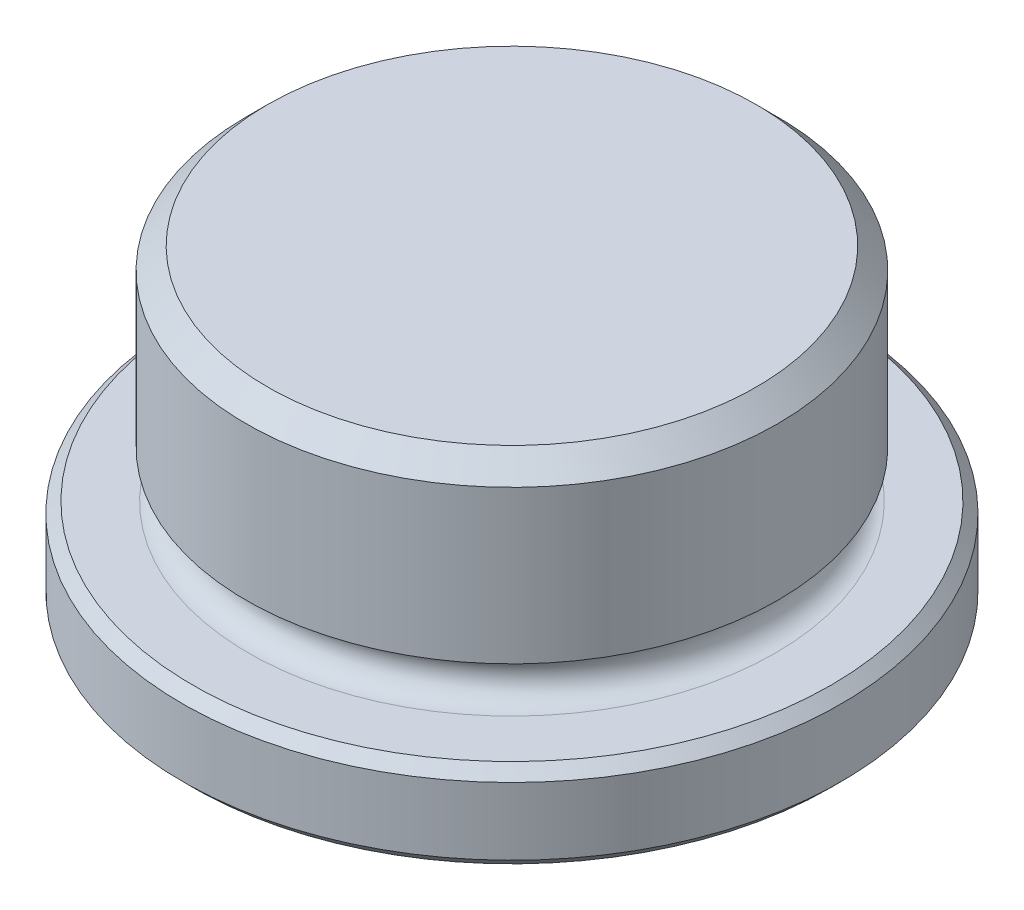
ISO-10303-21;
HEADER;
FILE_DESCRIPTION(('STEP AP214'),'2;1');
FILE_NAME('part.step','',(''),(''),'','','');
FILE_SCHEMA(('AUTOMOTIVE_DESIGN { 1 0 10303 214 1 1 1 1 }'));
ENDSEC;
DATA;
#1=APPLICATION_CONTEXT('core data for automotive mechanical design processes');
#2=APPLICATION_PROTOCOL_DEFINITION('international standard','automotive_design',2000,#1);
#3=PRODUCT_CONTEXT('',#1,'mechanical');
#4=PRODUCT('Part','Part','',(#3));
#5=PRODUCT_RELATED_PRODUCT_CATEGORY('part','',(#4));
#6=PRODUCT_DEFINITION_FORMATION('','',#4);
#7=PRODUCT_DEFINITION_CONTEXT('part definition',#1,'design');
#8=PRODUCT_DEFINITION('design','',#6,#7);
#9=PRODUCT_DEFINITION_SHAPE('','',#8);
#10=(LENGTH_UNIT() NAMED_UNIT(*) SI_UNIT(.MILLI.,.METRE.));
#11=(NAMED_UNIT(*) PLANE_ANGLE_UNIT() SI_UNIT($,.RADIAN.));
#12=(NAMED_UNIT(*) SI_UNIT($,.STERADIAN.) SOLID_ANGLE_UNIT());
#13=UNCERTAINTY_MEASURE_WITH_UNIT(LENGTH_MEASURE(1.E-05),#10,'distance_accuracy_value','');
#14=(GEOMETRIC_REPRESENTATION_CONTEXT(3) GLOBAL_UNCERTAINTY_ASSIGNED_CONTEXT((#13)) GLOBAL_UNIT_ASSIGNED_CONTEXT((#10,
#11,#12)) REPRESENTATION_CONTEXT('',''));
#15=CARTESIAN_POINT('',(0.,0.,0.));
#16=DIRECTION('',(0.,0.,1.));
#17=DIRECTION('',(1.,0.,0.));
#18=AXIS2_PLACEMENT_3D('',#15,#16,#17);
#19=CARTESIAN_POINT('',(8.763,11.0998,0.));
#20=DIRECTION('',(0.,-1.,0.));
#21=DIRECTION('',(1.,0.,0.));
#22=AXIS2_PLACEMENT_3D('',#19,#20,#21);
#23=PLANE('',#22);
#24=CARTESIAN_POINT('',(0.,11.0998,0.));
#25=DIRECTION('',(0.,1.,0.));
#26=DIRECTION('',(-1.,0.,0.));
#27=AXIS2_PLACEMENT_3D('',#24,#25,#26);
#28=CIRCLE('',#27,8.763);
#29=CARTESIAN_POINT('',(-8.763,11.0998,0.));
#30=VERTEX_POINT('',#29);
#31=EDGE_CURVE('E52',#30,#30,#28,.T.);
#32=ORIENTED_EDGE('',*,*,#31,.T.);
#33=EDGE_LOOP('',(#32));
#34=FACE_BOUND('',#33,.T.);
#35=ADVANCED_FACE('F39',(#34),#23,.F.);
#36=CARTESIAN_POINT('',(0.,10.3378,0.));
#37=DIRECTION('',(0.,-1.,0.));
#38=DIRECTION('',(1.,0.,0.));
#39=AXIS2_PLACEMENT_3D('',#36,#37,#38);
#40=CONICAL_SURFACE('',#39,9.525,0.785398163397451);
#41=ORIENTED_EDGE('',*,*,#31,.F.);
#42=EDGE_LOOP('',(#41));
#43=FACE_BOUND('',#42,.T.);
#44=CARTESIAN_POINT('',(0.,10.3378,0.));
#45=DIRECTION('',(0.,1.,0.));
#46=DIRECTION('',(-1.,0.,0.));
#47=AXIS2_PLACEMENT_3D('',#44,#45,#46);
#48=CIRCLE('',#47,9.525);
#49=CARTESIAN_POINT('',(-9.525,10.3378,0.));
#50=VERTEX_POINT('',#49);
#51=EDGE_CURVE('E143',#50,#50,#48,.T.);
#52=ORIENTED_EDGE('',*,*,#51,.T.);
#53=EDGE_LOOP('',(#52));
#54=FACE_BOUND('',#53,.T.);
#55=ADVANCED_FACE('F149',(#43,#54),#40,.T.);
#56=CARTESIAN_POINT('',(0.,11.0998,0.));
#57=DIRECTION('',(0.,1.,0.));
#58=DIRECTION('',(-1.,0.,0.));
#59=AXIS2_PLACEMENT_3D('',#56,#57,#58);
#60=CYLINDRICAL_SURFACE('',#59,9.525);
#61=ORIENTED_EDGE('',*,*,#51,.F.);
#62=EDGE_LOOP('',(#61));
#63=FACE_BOUND('',#62,.T.);
#64=CARTESIAN_POINT('',(0.,4.85873556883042,0.));
#65=DIRECTION('',(0.,1.,0.));
#66=DIRECTION('',(-1.,0.,0.));
#67=AXIS2_PLACEMENT_3D('',#64,#65,#66);
#68=CIRCLE('',#67,9.525);
#69=CARTESIAN_POINT('',(-9.525,4.85873556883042,0.));
#70=VERTEX_POINT('',#69);
#71=EDGE_CURVE('E140',#70,#70,#68,.T.);
#72=ORIENTED_EDGE('',*,*,#71,.T.);
#73=EDGE_LOOP('',(#72));
#74=FACE_BOUND('',#73,.T.);
#75=ADVANCED_FACE('F152',(#63,#74),#60,.T.);
#76=CARTESIAN_POINT('',(0.,4.72675409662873,0.));
#77=DIRECTION('',(0.,1.,0.));
#78=DIRECTION('',(-1.,0.,0.));
#79=AXIS2_PLACEMENT_3D('',#76,#77,#78);
#80=CONICAL_SURFACE('',#79,9.16238388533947,1.22173047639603);
#81=ORIENTED_EDGE('',*,*,#71,.F.);
#82=EDGE_LOOP('',(#81));
#83=FACE_BOUND('',#82,.T.);
#84=CARTESIAN_POINT('',(0.,4.72675409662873,0.));
#85=DIRECTION('',(0.,1.,0.));
#86=DIRECTION('',(-1.,0.,0.));
#87=AXIS2_PLACEMENT_3D('',#84,#85,#86);
#88=CIRCLE('',#87,9.16238388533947);
#89=CARTESIAN_POINT('',(-9.16238388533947,4.72675409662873,0.));
#90=VERTEX_POINT('',#89);
#91=EDGE_CURVE('E137',#90,#90,#88,.T.);
#92=ORIENTED_EDGE('',*,*,#91,.T.);
#93=EDGE_LOOP('',(#92));
#94=FACE_BOUND('',#93,.T.);
#95=ADVANCED_FACE('F157',(#83,#94),#80,.T.);
#96=CARTESIAN_POINT('',(0.,3.975,0.));
#97=DIRECTION('',(0.,1.,0.));
#98=DIRECTION('',(-1.,0.,0.));
#99=AXIS2_PLACEMENT_3D('',#96,#97,#98);
#100=TOROIDAL_SURFACE('',#99,9.436,0.799999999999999);
#101=ORIENTED_EDGE('',*,*,#91,.F.);
#102=EDGE_LOOP('',(#101));
#103=FACE_BOUND('',#102,.T.);
#104=CARTESIAN_POINT('',(0.,3.175,0.));
#105=DIRECTION('',(0.,1.,0.));
#106=DIRECTION('',(-1.,0.,0.));
#107=AXIS2_PLACEMENT_3D('',#104,#105,#106);
#108=CIRCLE('',#107,9.436);
#109=CARTESIAN_POINT('',(-9.436,3.175,0.));
#110=VERTEX_POINT('',#109);
#111=EDGE_CURVE('E134',#110,#110,#108,.T.);
#112=ORIENTED_EDGE('',*,*,#111,.T.);
#113=EDGE_LOOP('',(#112));
#114=FACE_BOUND('',#113,.T.);
#115=ADVANCED_FACE('F163',(#103,#114),#100,.F.);
#116=CARTESIAN_POINT('',(11.43,3.175,0.));
#117=DIRECTION('',(0.,-1.,0.));
#118=DIRECTION('',(1.,0.,0.));
#119=AXIS2_PLACEMENT_3D('',#116,#117,#118);
#120=PLANE('',#119);
#121=ORIENTED_EDGE('',*,*,#111,.F.);
#122=EDGE_LOOP('',(#121));
#123=FACE_BOUND('',#122,.T.);
#124=CARTESIAN_POINT('',(0.,3.175,0.));
#125=DIRECTION('',(0.,1.,0.));
#126=DIRECTION('',(-1.,0.,0.));
#127=AXIS2_PLACEMENT_3D('',#124,#125,#126);
#128=CIRCLE('',#127,11.43);
#129=CARTESIAN_POINT('',(-11.43,3.175,0.));
#130=VERTEX_POINT('',#129);
#131=EDGE_CURVE('E131',#130,#130,#128,.T.);
#132=ORIENTED_EDGE('',*,*,#131,.T.);
#133=EDGE_LOOP('',(#132));
#134=FACE_BOUND('',#133,.T.);
#135=ADVANCED_FACE('F169',(#123,#134),#120,.F.);
#136=CARTESIAN_POINT('',(0.,2.794,0.));
#137=DIRECTION('',(0.,-1.,0.));
#138=DIRECTION('',(1.,0.,0.));
#139=AXIS2_PLACEMENT_3D('',#136,#137,#138);
#140=CONICAL_SURFACE('',#139,11.811,0.785398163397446);
#141=ORIENTED_EDGE('',*,*,#131,.F.);
#142=EDGE_LOOP('',(#141));
#143=FACE_BOUND('',#142,.T.);
#144=CARTESIAN_POINT('',(0.,2.794,0.));
#145=DIRECTION('',(0.,1.,0.));
#146=DIRECTION('',(-1.,0.,0.));
#147=AXIS2_PLACEMENT_3D('',#144,#145,#146);
#148=CIRCLE('',#147,11.811);
#149=CARTESIAN_POINT('',(-11.811,2.794,0.));
#150=VERTEX_POINT('',#149);
#151=EDGE_CURVE('E128',#150,#150,#148,.T.);
#152=ORIENTED_EDGE('',*,*,#151,.T.);
#153=EDGE_LOOP('',(#152));
#154=FACE_BOUND('',#153,.T.);
#155=ADVANCED_FACE('F175',(#143,#154),#140,.T.);
#156=CARTESIAN_POINT('',(0.,11.0998,0.));
#157=DIRECTION('',(0.,1.,0.));
#158=DIRECTION('',(-1.,0.,0.));
#159=AXIS2_PLACEMENT_3D('',#156,#157,#158);
#160=CYLINDRICAL_SURFACE('',#159,11.811);
#161=ORIENTED_EDGE('',*,*,#151,.F.);
#162=EDGE_LOOP('',(#161));
#163=FACE_BOUND('',#162,.T.);
#164=CARTESIAN_POINT('',(0.,0.380999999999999,0.));
#165=DIRECTION('',(0.,1.,0.));
#166=DIRECTION('',(-1.,0.,0.));
#167=AXIS2_PLACEMENT_3D('',#164,#165,#166);
#168=CIRCLE('',#167,11.811);
#169=CARTESIAN_POINT('',(-11.811,0.381,0.));
#170=VERTEX_POINT('',#169);
#171=EDGE_CURVE('E125',#170,#170,#168,.T.);
#172=ORIENTED_EDGE('',*,*,#171,.T.);
#173=EDGE_LOOP('',(#172));
#174=FACE_BOUND('',#173,.T.);
#175=ADVANCED_FACE('F181',(#163,#174),#160,.T.);
#176=CARTESIAN_POINT('',(0.,0.,0.));
#177=DIRECTION('',(0.,1.,0.));
#178=DIRECTION('',(-1.,0.,0.));
#179=AXIS2_PLACEMENT_3D('',#176,#177,#178);
#180=CONICAL_SURFACE('',#179,11.43,0.785398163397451);
#181=ORIENTED_EDGE('',*,*,#171,.F.);
#182=EDGE_LOOP('',(#181));
#183=FACE_BOUND('',#182,.T.);
#184=CARTESIAN_POINT('',(0.,0.,0.));
#185=DIRECTION('',(0.,1.,0.));
#186=DIRECTION('',(-1.,0.,0.));
#187=AXIS2_PLACEMENT_3D('',#184,#185,#186);
#188=CIRCLE('',#187,11.43);
#189=CARTESIAN_POINT('',(-11.43,0.,0.));
#190=VERTEX_POINT('',#189);
#191=EDGE_CURVE('E122',#190,#190,#188,.T.);
#192=ORIENTED_EDGE('',*,*,#191,.T.);
#193=EDGE_LOOP('',(#192));
#194=FACE_BOUND('',#193,.T.);
#195=ADVANCED_FACE('F187',(#183,#194),#180,.T.);
#196=CARTESIAN_POINT('',(0.,0.,0.));
#197=DIRECTION('',(0.,1.,0.));
#198=DIRECTION('',(-1.,0.,0.));
#199=AXIS2_PLACEMENT_3D('',#196,#197,#198);
#200=PLANE('',#199);
#201=CARTESIAN_POINT('',(0.,0.,0.));
#202=DIRECTION('',(0.,1.,0.));
#203=DIRECTION('',(0.,0.,1.));
#204=AXIS2_PLACEMENT_3D('',#201,#202,#203);
#205=CIRCLE('',#204,5.75326131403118);
#206=CARTESIAN_POINT('',(0.,0.,5.75326131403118));
#207=VERTEX_POINT('',#206);
#208=EDGE_CURVE('E418',#207,#207,#205,.T.);
#209=ORIENTED_EDGE('',*,*,#208,.T.);
#210=EDGE_LOOP('',(#209));
#211=FACE_BOUND('',#210,.T.);
#212=ORIENTED_EDGE('',*,*,#191,.F.);
#213=EDGE_LOOP('',(#212));
#214=FACE_BOUND('',#213,.T.);
#215=ADVANCED_FACE('F193',(#211,#214),#200,.F.);
#216=CARTESIAN_POINT('',(0.,3.70346252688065,0.));
#217=DIRECTION('',(0.,-1.,0.));
#218=DIRECTION('',(0.,0.,-1.));
#219=AXIS2_PLACEMENT_3D('',#216,#217,#218);
#220=CONICAL_SURFACE('',#219,2.0497987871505,0.785398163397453);
#221=ORIENTED_EDGE('',*,*,#208,.F.);
#222=EDGE_LOOP('',(#221));
#223=FACE_BOUND('',#222,.T.);
#224=CARTESIAN_POINT('',(5.49937678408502,0.253884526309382,-0.000200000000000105));
#225=CARTESIAN_POINT('',(5.45209794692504,0.301159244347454,0.0816893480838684));
#226=CARTESIAN_POINT('',(5.40445569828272,0.346983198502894,0.164208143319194));
#227=CARTESIAN_POINT('',(5.30837307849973,0.435288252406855,0.330628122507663));
#228=CARTESIAN_POINT('',(5.25993228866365,0.477767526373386,0.414530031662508));
#229=CARTESIAN_POINT('',(5.11285510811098,0.599888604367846,0.669275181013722));
#230=CARTESIAN_POINT('',(5.01297361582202,0.673692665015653,0.842275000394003));
#231=CARTESIAN_POINT('',(4.81155458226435,0.800077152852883,1.19114300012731));
#232=CARTESIAN_POINT('',(4.71006852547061,0.852975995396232,1.36692200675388));
#233=CARTESIAN_POINT('',(4.55617092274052,0.914167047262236,1.63348047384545));
#234=CARTESIAN_POINT('',(4.5046451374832,0.931529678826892,1.72272575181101));
#235=CARTESIAN_POINT('',(4.40115727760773,0.959809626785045,1.90197198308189));
#236=CARTESIAN_POINT('',(4.34919526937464,0.970727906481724,1.99197282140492));
#237=CARTESIAN_POINT('',(4.22257233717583,0.98903382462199,2.2112901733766));
#238=CARTESIAN_POINT('',(4.14777498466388,0.992874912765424,2.34084298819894));
#239=CARTESIAN_POINT('',(3.99831507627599,0.986428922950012,2.59971514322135));
#240=CARTESIAN_POINT('',(3.92365257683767,0.976136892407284,2.72903438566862));
#241=CARTESIAN_POINT('',(3.77503146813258,0.942031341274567,2.98645369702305));
#242=CARTESIAN_POINT('',(3.7010737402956,0.91820269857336,3.11455223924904));
#243=CARTESIAN_POINT('',(3.554429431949,0.858319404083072,3.36854763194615));
#244=CARTESIAN_POINT('',(3.4817427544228,0.822265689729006,3.49444465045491));
#245=CARTESIAN_POINT('',(3.35270833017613,0.7480905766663,3.71793882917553));
#246=CARTESIAN_POINT('',(3.29607491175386,0.711919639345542,3.81603078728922));
#247=CARTESIAN_POINT('',(3.18382475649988,0.633748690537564,4.0104537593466));
#248=CARTESIAN_POINT('',(3.12820805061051,0.591748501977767,4.1067847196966));
#249=CARTESIAN_POINT('',(3.01816648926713,0.502860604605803,4.29738229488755));
#250=CARTESIAN_POINT('',(2.96373850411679,0.455988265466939,4.39165433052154));
#251=CARTESIAN_POINT('',(2.85589043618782,0.357971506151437,4.57845266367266));
#252=CARTESIAN_POINT('',(2.80246975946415,0.306829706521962,4.67097998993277));
#253=CARTESIAN_POINT('',(2.74951518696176,0.253884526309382,4.7627));
#254=B_SPLINE_CURVE_WITH_KNOTS('',3,(#224,#225,#226,#227,#228,#229,#230,#231,#232,#233,#234,
#235,#236,#237,#238,#239,#240,#241,#242,#243,#244,#245,#246,#247,#248,#249,#250,#251,#252,#253),
.UNSPECIFIED.,.F.,.F.,(4,2,2,2,2,2,2,2,2,2,2,2,2,2,4),(0.,0.317131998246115,0.634435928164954,
1.2724696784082,1.90037160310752,2.21370673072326,2.52699500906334,2.97522950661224,
3.42362111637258,3.87251462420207,4.32137371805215,4.67791268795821,5.03446249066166,
5.38991982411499,5.74516056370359),.UNSPECIFIED.);
#255=CARTESIAN_POINT('',(5.49926131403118,0.253999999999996,0.));
#256=VERTEX_POINT('',#255);
#257=CARTESIAN_POINT('',(2.74963065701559,0.253999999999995,4.7625));
#258=VERTEX_POINT('',#257);
#259=EDGE_CURVE('E106',#256,#258,#254,.T.);
#260=ORIENTED_EDGE('',*,*,#259,.F.);
#261=CARTESIAN_POINT('',(2.74951518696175,0.253884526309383,-4.7627));
#262=CARTESIAN_POINT('',(2.79679402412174,0.301159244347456,-4.68081065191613));
#263=CARTESIAN_POINT('',(2.84443627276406,0.346983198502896,-4.5982918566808));
#264=CARTESIAN_POINT('',(2.94051889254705,0.435288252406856,-4.43187187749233));
#265=CARTESIAN_POINT('',(2.98895968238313,0.477767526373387,-4.34796996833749));
#266=CARTESIAN_POINT('',(3.1360368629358,0.599888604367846,-4.09322481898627));
#267=CARTESIAN_POINT('',(3.23591835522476,0.673692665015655,-3.920224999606));
#268=CARTESIAN_POINT('',(3.43733738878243,0.800077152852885,-3.57135699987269));
#269=CARTESIAN_POINT('',(3.53882344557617,0.852975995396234,-3.39557799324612));
#270=CARTESIAN_POINT('',(3.69272104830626,0.914167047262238,-3.12901952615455));
#271=CARTESIAN_POINT('',(3.74424683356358,0.931529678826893,-3.03977424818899));
#272=CARTESIAN_POINT('',(3.84773469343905,0.959809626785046,-2.86052801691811));
#273=CARTESIAN_POINT('',(3.89969670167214,0.970727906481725,-2.77052717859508));
#274=CARTESIAN_POINT('',(4.02631963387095,0.989033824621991,-2.5512098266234));
#275=CARTESIAN_POINT('',(4.1011169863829,0.992874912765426,-2.42165701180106));
#276=CARTESIAN_POINT('',(4.25057689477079,0.986428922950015,-2.16278485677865));
#277=CARTESIAN_POINT('',(4.32523939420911,0.976136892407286,-2.03346561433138));
#278=CARTESIAN_POINT('',(4.4738605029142,0.942031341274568,-1.77604630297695));
#279=CARTESIAN_POINT('',(4.54781823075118,0.918202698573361,-1.64794776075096));
#280=CARTESIAN_POINT('',(4.69446253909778,0.858319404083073,-1.39395236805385));
#281=CARTESIAN_POINT('',(4.76714921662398,0.822265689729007,-1.26805534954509));
#282=CARTESIAN_POINT('',(4.89618364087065,0.748090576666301,-1.04456117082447));
#283=CARTESIAN_POINT('',(4.95281705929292,0.711919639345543,-0.946469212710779));
#284=CARTESIAN_POINT('',(5.0650672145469,0.633748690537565,-0.752046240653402));
#285=CARTESIAN_POINT('',(5.12068392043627,0.591748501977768,-0.655715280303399));
#286=CARTESIAN_POINT('',(5.23072548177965,0.502860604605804,-0.465117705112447));
#287=CARTESIAN_POINT('',(5.28515346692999,0.45598826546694,-0.370845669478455));
#288=CARTESIAN_POINT('',(5.39300153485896,0.357971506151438,-0.184047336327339));
#289=CARTESIAN_POINT('',(5.44642221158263,0.306829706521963,-0.0915200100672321));
#290=CARTESIAN_POINT('',(5.49937678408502,0.253884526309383,0.000200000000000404));
#291=B_SPLINE_CURVE_WITH_KNOTS('',3,(#261,#262,#263,#264,#265,#266,#267,#268,#269,#270,#271,
#272,#273,#274,#275,#276,#277,#278,#279,#280,#281,#282,#283,#284,#285,#286,#287,#288,#289,#290),
.UNSPECIFIED.,.F.,.F.,(4,2,2,2,2,2,2,2,2,2,2,2,2,2,4),(0.,0.317131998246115,0.634435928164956,
1.2724696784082,1.90037160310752,2.21370673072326,2.52699500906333,2.97522950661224,
3.42362111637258,3.87251462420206,4.32137371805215,4.67791268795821,5.03446249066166,
5.38991982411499,5.74516056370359),.UNSPECIFIED.);
#292=CARTESIAN_POINT('',(2.74963065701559,0.253999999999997,-4.7625));
#293=VERTEX_POINT('',#292);
#294=EDGE_CURVE('E404',#293,#256,#291,.T.);
#295=ORIENTED_EDGE('',*,*,#294,.F.);
#296=CARTESIAN_POINT('',(-9.37987663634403,-4.76641035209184,-4.7625));
#297=CARTESIAN_POINT('',(-9.24308343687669,-4.64444125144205,-4.7625));
#298=CARTESIAN_POINT('',(-9.10602152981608,-4.52277352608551,-4.7625));
#299=CARTESIAN_POINT('',(-8.83128679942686,-4.28012666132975,-4.7625));
#300=CARTESIAN_POINT('',(-8.69361396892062,-4.15914753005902,-4.7625));
#301=CARTESIAN_POINT('',(-8.27947694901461,-3.79729156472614,-4.7625));
#302=CARTESIAN_POINT('',(-8.00199000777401,-3.55758176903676,-4.7625));
#303=CARTESIAN_POINT('',(-7.44005764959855,-3.07928163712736,-4.7625));
#304=CARTESIAN_POINT('',(-7.155568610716,-2.84074240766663,-4.7625));
#305=CARTESIAN_POINT('',(-6.58198155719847,-2.36937067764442,-4.7625));
#306=CARTESIAN_POINT('',(-6.29288447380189,-2.13653704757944,-4.7625));
#307=CARTESIAN_POINT('',(-5.72492406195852,-1.69164785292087,-4.7625));
#308=CARTESIAN_POINT('',(-5.44640161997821,-1.47916066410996,-4.7625));
#309=CARTESIAN_POINT('',(-5.0229777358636,-1.16791096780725,-4.7625));
#310=CARTESIAN_POINT('',(-4.88084995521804,-1.06537626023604,-4.7625));
#311=CARTESIAN_POINT('',(-4.59443356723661,-0.863376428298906,-4.7625));
#312=CARTESIAN_POINT('',(-4.45014507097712,-0.763911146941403,-4.7625));
#313=CARTESIAN_POINT('',(-4.15946725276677,-0.568999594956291,-4.7625));
#314=CARTESIAN_POINT('',(-4.01308510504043,-0.473542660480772,-4.7625));
#315=CARTESIAN_POINT('',(-3.71740287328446,-0.28721107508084,-4.7625));
#316=CARTESIAN_POINT('',(-3.56810254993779,-0.196336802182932,-4.7625));
#317=CARTESIAN_POINT('',(-3.26630319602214,-0.0203963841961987,-4.7625));
#318=CARTESIAN_POINT('',(-3.11380757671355,0.0646755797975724,-4.7625));
#319=CARTESIAN_POINT('',(-2.80504320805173,0.227640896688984,-4.7625));
#320=CARTESIAN_POINT('',(-2.6487753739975,0.305535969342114,-4.7625));
#321=CARTESIAN_POINT('',(-2.34333397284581,0.447072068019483,-4.7625));
#322=CARTESIAN_POINT('',(-2.19445020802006,0.511333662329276,-4.7625));
#323=CARTESIAN_POINT('',(-1.8928559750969,0.630262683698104,-4.7625));
#324=CARTESIAN_POINT('',(-1.74014550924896,0.684930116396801,-4.7625));
#325=CARTESIAN_POINT('',(-1.43171334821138,0.782353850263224,-4.7625));
#326=CARTESIAN_POINT('',(-1.27600927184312,0.825165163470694,-4.7625));
#327=CARTESIAN_POINT('',(-0.961481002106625,0.897084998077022,-4.7625));
#328=CARTESIAN_POINT('',(-0.802658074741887,0.926198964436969,-4.7625));
#329=CARTESIAN_POINT('',(-0.480440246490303,0.969290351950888,-4.7625));
#330=CARTESIAN_POINT('',(-0.317012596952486,0.98302810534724,-4.7625));
#331=CARTESIAN_POINT('',(0.0103831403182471,0.993560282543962,-4.7625));
#332=CARTESIAN_POINT('',(0.174351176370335,0.990356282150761,-4.7625));
#333=CARTESIAN_POINT('',(0.501477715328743,0.967220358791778,-4.7625));
#334=CARTESIAN_POINT('',(0.664633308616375,0.94724807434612,-4.7625));
#335=CARTESIAN_POINT('',(0.98830158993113,0.891916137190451,-4.7625));
#336=CARTESIAN_POINT('',(1.14881351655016,0.856552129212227,-4.7625));
#337=CARTESIAN_POINT('',(1.5158811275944,0.759372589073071,-4.7625));
#338=CARTESIAN_POINT('',(1.72115283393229,0.692744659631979,-4.7625));
#339=CARTESIAN_POINT('',(2.12494286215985,0.54157874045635,-4.7625));
#340=CARTESIAN_POINT('',(2.32345726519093,0.457030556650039,-4.7625));
#341=CARTESIAN_POINT('',(2.71614026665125,0.273446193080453,-4.7625));
#342=CARTESIAN_POINT('',(2.91024121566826,0.174267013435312,-4.7625));
#343=CARTESIAN_POINT('',(3.19705270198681,0.0177434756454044,-4.7625));
#344=CARTESIAN_POINT('',(3.2919229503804,-0.0357171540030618,-4.7625));
#345=CARTESIAN_POINT('',(3.48035243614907,-0.144904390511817,-4.7625));
#346=CARTESIAN_POINT('',(3.57391167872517,-0.20063098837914,-4.7625));
#347=CARTESIAN_POINT('',(3.80071811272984,-0.338996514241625,-4.7625));
#348=CARTESIAN_POINT('',(3.93332059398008,-0.422691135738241,-4.7625));
#349=CARTESIAN_POINT('',(4.1963435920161,-0.593448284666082,-4.7625));
#350=CARTESIAN_POINT('',(4.32676393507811,-0.680511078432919,-4.7625));
#351=CARTESIAN_POINT('',(4.71524490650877,-0.945919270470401,-4.7625));
#352=CARTESIAN_POINT('',(4.97045352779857,-1.12843972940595,-4.7625));
#353=CARTESIAN_POINT('',(5.47549688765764,-1.50163926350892,-4.7625));
#354=CARTESIAN_POINT('',(5.72532092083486,-1.69233267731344,-4.7625));
#355=CARTESIAN_POINT('',(6.2204754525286,-2.07948478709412,-4.7625));
#356=CARTESIAN_POINT('',(6.4658056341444,-2.27594388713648,-4.7625));
#357=CARTESIAN_POINT('',(6.93717767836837,-2.66032821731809,-4.7625));
#358=CARTESIAN_POINT('',(7.16344063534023,-2.84798334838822,-4.7625));
#359=CARTESIAN_POINT('',(7.61348980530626,-3.22625903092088,-4.7625));
#360=CARTESIAN_POINT('',(7.83727589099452,-3.41687973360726,-4.7625));
#361=CARTESIAN_POINT('',(8.28181433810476,-3.79959672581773,-4.7625));
#362=CARTESIAN_POINT('',(8.50257585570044,-3.99168240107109,-4.7625));
#363=CARTESIAN_POINT('',(8.94240582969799,-4.37773547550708,-4.7625));
#364=CARTESIAN_POINT('',(9.16147446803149,-4.57170266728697,-4.7625));
#365=CARTESIAN_POINT('',(9.37987663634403,-4.76641035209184,-4.7625));
#366=B_SPLINE_CURVE_WITH_KNOTS('',3,(#296,#297,#298,#299,#300,#301,#302,#303,#304,#305,#306,
#307,#308,#309,#310,#311,#312,#313,#314,#315,#316,#317,#318,#319,#320,#321,#322,#323,#324,#325,
#326,#327,#328,#329,#330,#331,#332,#333,#334,#335,#336,#337,#338,#339,#340,#341,#342,#343,#344,
#345,#346,#347,#348,#349,#350,#351,#352,#353,#354,#355,#356,#357,#358,#359,#360,#361,#362,#363,
#364,#365),.UNSPECIFIED.,.F.,.F.,(4,2,2,2,2,2,2,2,2,2,2,2,2,2,2,2,2,2,2,2,2,2,2,2,2,2,2,2,2,2,2,
2,2,2,4),(0.,0.549816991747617,1.09964046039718,2.19967276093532,3.31340261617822,
4.42691018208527,5.47769242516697,6.003420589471,6.52912181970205,7.05332212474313,
7.57756560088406,8.10127535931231,8.62485929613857,9.11107015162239,9.59728072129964,
10.0811959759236,10.5649187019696,11.0560805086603,11.5471966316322,12.0394982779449,
12.5319393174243,13.1782469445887,13.8249232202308,14.4783996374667,14.8050655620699,
15.131730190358,15.6020838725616,16.0724748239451,17.0135106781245,17.9562710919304,
18.8990977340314,19.7809321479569,20.6628116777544,21.5406912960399,22.4184752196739),.UNSPECIFIED.);
#367=CARTESIAN_POINT('',(-2.74963065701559,0.253999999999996,-4.7625));
#368=VERTEX_POINT('',#367);
#369=EDGE_CURVE('E399',#368,#293,#366,.T.);
#370=ORIENTED_EDGE('',*,*,#369,.F.);
#371=CARTESIAN_POINT('',(-5.49937678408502,0.253884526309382,0.000200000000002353));
#372=CARTESIAN_POINT('',(-5.45209794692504,0.301159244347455,-0.081689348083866));
#373=CARTESIAN_POINT('',(-5.40445569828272,0.346983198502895,-0.164208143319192));
#374=CARTESIAN_POINT('',(-5.30837307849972,0.435288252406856,-0.330628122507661));
#375=CARTESIAN_POINT('',(-5.25993228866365,0.477767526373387,-0.414530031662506));
#376=CARTESIAN_POINT('',(-5.11285510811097,0.599888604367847,-0.669275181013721));
#377=CARTESIAN_POINT('',(-5.01297361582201,0.673692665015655,-0.842275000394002));
#378=CARTESIAN_POINT('',(-4.81155458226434,0.800077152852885,-1.19114300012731));
#379=CARTESIAN_POINT('',(-4.71006852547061,0.852975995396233,-1.36692200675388));
#380=CARTESIAN_POINT('',(-4.55617092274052,0.914167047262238,-1.63348047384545));
#381=CARTESIAN_POINT('',(-4.5046451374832,0.931529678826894,-1.72272575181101));
#382=CARTESIAN_POINT('',(-4.40115727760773,0.959809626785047,-1.90197198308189));
#383=CARTESIAN_POINT('',(-4.34919526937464,0.970727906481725,-1.99197282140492));
#384=CARTESIAN_POINT('',(-4.22257233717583,0.989033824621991,-2.2112901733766));
#385=CARTESIAN_POINT('',(-4.14777498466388,0.992874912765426,-2.34084298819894));
#386=CARTESIAN_POINT('',(-3.99831507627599,0.986428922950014,-2.59971514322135));
#387=CARTESIAN_POINT('',(-3.92365257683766,0.976136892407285,-2.72903438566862));
#388=CARTESIAN_POINT('',(-3.77503146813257,0.942031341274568,-2.98645369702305));
#389=CARTESIAN_POINT('',(-3.7010737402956,0.91820269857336,-3.11455223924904));
#390=CARTESIAN_POINT('',(-3.554429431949,0.858319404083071,-3.36854763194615));
#391=CARTESIAN_POINT('',(-3.48174275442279,0.822265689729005,-3.49444465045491));
#392=CARTESIAN_POINT('',(-3.35270833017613,0.748090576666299,-3.71793882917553));
#393=CARTESIAN_POINT('',(-3.29607491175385,0.711919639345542,-3.81603078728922));
#394=CARTESIAN_POINT('',(-3.18382475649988,0.633748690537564,-4.0104537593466));
#395=CARTESIAN_POINT('',(-3.12820805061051,0.591748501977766,-4.1067847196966));
#396=CARTESIAN_POINT('',(-3.01816648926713,0.502860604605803,-4.29738229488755));
#397=CARTESIAN_POINT('',(-2.96373850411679,0.45598826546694,-4.39165433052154));
#398=CARTESIAN_POINT('',(-2.85589043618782,0.357971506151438,-4.57845266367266));
#399=CARTESIAN_POINT('',(-2.80246975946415,0.306829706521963,-4.67097998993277));
#400=CARTESIAN_POINT('',(-2.74951518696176,0.253884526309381,-4.7627));
#401=B_SPLINE_CURVE_WITH_KNOTS('',3,(#371,#372,#373,#374,#375,#376,#377,#378,#379,#380,#381,
#382,#383,#384,#385,#386,#387,#388,#389,#390,#391,#392,#393,#394,#395,#396,#397,#398,#399,#400),
.UNSPECIFIED.,.F.,.F.,(4,2,2,2,2,2,2,2,2,2,2,2,2,2,4),(0.,0.317131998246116,0.634435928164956,
1.2724696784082,1.90037160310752,2.21370673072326,2.52699500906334,2.97522950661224,
3.42362111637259,3.87251462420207,4.32137371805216,4.67791268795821,5.03446249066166,
5.38991982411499,5.74516056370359),.UNSPECIFIED.);
#402=CARTESIAN_POINT('',(-5.49926131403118,0.253999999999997,0.));
#403=VERTEX_POINT('',#402);
#404=EDGE_CURVE('E59',#403,#368,#401,.T.);
#405=ORIENTED_EDGE('',*,*,#404,.F.);
#406=CARTESIAN_POINT('',(-2.74951518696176,0.253884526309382,4.7627));
#407=CARTESIAN_POINT('',(-2.79679402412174,0.301159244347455,4.68081065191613));
#408=CARTESIAN_POINT('',(-2.84443627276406,0.346983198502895,4.59829185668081));
#409=CARTESIAN_POINT('',(-2.94051889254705,0.435288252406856,4.43187187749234));
#410=CARTESIAN_POINT('',(-2.98895968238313,0.477767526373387,4.34796996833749));
#411=CARTESIAN_POINT('',(-3.1360368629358,0.599888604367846,4.09322481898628));
#412=CARTESIAN_POINT('',(-3.23591835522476,0.673692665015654,3.92022499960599));
#413=CARTESIAN_POINT('',(-3.43733738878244,0.800077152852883,3.57135699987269));
#414=CARTESIAN_POINT('',(-3.53882344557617,0.852975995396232,3.39557799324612));
#415=CARTESIAN_POINT('',(-3.69272104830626,0.914167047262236,3.12901952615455));
#416=CARTESIAN_POINT('',(-3.74424683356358,0.931529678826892,3.03977424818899));
#417=CARTESIAN_POINT('',(-3.84773469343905,0.959809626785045,2.86052801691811));
#418=CARTESIAN_POINT('',(-3.89969670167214,0.970727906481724,2.77052717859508));
#419=CARTESIAN_POINT('',(-4.02631963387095,0.98903382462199,2.5512098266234));
#420=CARTESIAN_POINT('',(-4.1011169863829,0.992874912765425,2.42165701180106));
#421=CARTESIAN_POINT('',(-4.25057689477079,0.986428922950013,2.16278485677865));
#422=CARTESIAN_POINT('',(-4.32523939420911,0.976136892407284,2.03346561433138));
#423=CARTESIAN_POINT('',(-4.47386050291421,0.942031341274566,1.77604630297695));
#424=CARTESIAN_POINT('',(-4.54781823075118,0.918202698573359,1.64794776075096));
#425=CARTESIAN_POINT('',(-4.69446253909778,0.858319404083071,1.39395236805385));
#426=CARTESIAN_POINT('',(-4.76714921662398,0.822265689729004,1.26805534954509));
#427=CARTESIAN_POINT('',(-4.89618364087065,0.748090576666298,1.04456117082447));
#428=CARTESIAN_POINT('',(-4.95281705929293,0.711919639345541,0.946469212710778));
#429=CARTESIAN_POINT('',(-5.0650672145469,0.633748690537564,0.752046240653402));
#430=CARTESIAN_POINT('',(-5.12068392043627,0.591748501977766,0.655715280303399));
#431=CARTESIAN_POINT('',(-5.23072548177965,0.502860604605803,0.465117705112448));
#432=CARTESIAN_POINT('',(-5.28515346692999,0.45598826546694,0.370845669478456));
#433=CARTESIAN_POINT('',(-5.39300153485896,0.357971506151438,0.18404733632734));
#434=CARTESIAN_POINT('',(-5.44642221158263,0.306829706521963,0.0915200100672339));
#435=CARTESIAN_POINT('',(-5.49937678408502,0.253884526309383,-0.000199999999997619));
#436=B_SPLINE_CURVE_WITH_KNOTS('',3,(#406,#407,#408,#409,#410,#411,#412,#413,#414,#415,#416,
#417,#418,#419,#420,#421,#422,#423,#424,#425,#426,#427,#428,#429,#430,#431,#432,#433,#434,#435),
.UNSPECIFIED.,.F.,.F.,(4,2,2,2,2,2,2,2,2,2,2,2,2,2,4),(0.,0.317131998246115,0.634435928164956,
1.2724696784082,1.90037160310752,2.21370673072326,2.52699500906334,2.97522950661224,
3.42362111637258,3.87251462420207,4.32137371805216,4.67791268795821,5.03446249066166,
5.38991982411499,5.74516056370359),.UNSPECIFIED.);
#437=CARTESIAN_POINT('',(-2.74963065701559,0.253999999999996,4.7625));
#438=VERTEX_POINT('',#437);
#439=EDGE_CURVE('E11',#438,#403,#436,.T.);
#440=ORIENTED_EDGE('',*,*,#439,.F.);
#441=CARTESIAN_POINT('',(9.37987663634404,-4.76641035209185,4.7625));
#442=CARTESIAN_POINT('',(9.2430834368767,-4.64444125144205,4.7625));
#443=CARTESIAN_POINT('',(9.10602152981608,-4.52277352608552,4.7625));
#444=CARTESIAN_POINT('',(8.83128679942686,-4.28012666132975,4.7625));
#445=CARTESIAN_POINT('',(8.69361396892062,-4.15914753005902,4.7625));
#446=CARTESIAN_POINT('',(8.27947694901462,-3.79729156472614,4.7625));
#447=CARTESIAN_POINT('',(8.00199000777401,-3.55758176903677,4.7625));
#448=CARTESIAN_POINT('',(7.44005764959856,-3.07928163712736,4.7625));
#449=CARTESIAN_POINT('',(7.155568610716,-2.84074240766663,4.7625));
#450=CARTESIAN_POINT('',(6.58198155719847,-2.36937067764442,4.7625));
#451=CARTESIAN_POINT('',(6.29288447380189,-2.13653704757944,4.7625));
#452=CARTESIAN_POINT('',(5.72492406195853,-1.69164785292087,4.7625));
#453=CARTESIAN_POINT('',(5.44640161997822,-1.47916066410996,4.7625));
#454=CARTESIAN_POINT('',(5.02297773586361,-1.16791096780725,4.7625));
#455=CARTESIAN_POINT('',(4.88084995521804,-1.06537626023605,4.7625));
#456=CARTESIAN_POINT('',(4.59443356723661,-0.863376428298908,4.7625));
#457=CARTESIAN_POINT('',(4.45014507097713,-0.763911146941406,4.7625));
#458=CARTESIAN_POINT('',(4.15946725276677,-0.568999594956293,4.7625));
#459=CARTESIAN_POINT('',(4.01308510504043,-0.473542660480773,4.7625));
#460=CARTESIAN_POINT('',(3.71740287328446,-0.287211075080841,4.7625));
#461=CARTESIAN_POINT('',(3.56810254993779,-0.196336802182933,4.7625));
#462=CARTESIAN_POINT('',(3.26630319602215,-0.0203963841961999,4.7625));
#463=CARTESIAN_POINT('',(3.11380757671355,0.0646755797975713,4.7625));
#464=CARTESIAN_POINT('',(2.80504320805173,0.227640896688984,4.7625));
#465=CARTESIAN_POINT('',(2.6487753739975,0.305535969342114,4.7625));
#466=CARTESIAN_POINT('',(2.34333397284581,0.447072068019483,4.7625));
#467=CARTESIAN_POINT('',(2.19445020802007,0.511333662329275,4.7625));
#468=CARTESIAN_POINT('',(1.8928559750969,0.630262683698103,4.7625));
#469=CARTESIAN_POINT('',(1.74014550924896,0.684930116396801,4.7625));
#470=CARTESIAN_POINT('',(1.43171334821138,0.782353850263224,4.7625));
#471=CARTESIAN_POINT('',(1.27600927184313,0.825165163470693,4.7625));
#472=CARTESIAN_POINT('',(0.961481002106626,0.897084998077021,4.7625));
#473=CARTESIAN_POINT('',(0.802658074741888,0.926198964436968,4.7625));
#474=CARTESIAN_POINT('',(0.480440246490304,0.969290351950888,4.7625));
#475=CARTESIAN_POINT('',(0.317012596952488,0.983028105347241,4.7625));
#476=CARTESIAN_POINT('',(-0.0103831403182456,0.993560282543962,4.7625));
#477=CARTESIAN_POINT('',(-0.174351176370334,0.99035628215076,4.7625));
#478=CARTESIAN_POINT('',(-0.501477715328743,0.967220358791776,4.7625));
#479=CARTESIAN_POINT('',(-0.664633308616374,0.947248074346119,4.7625));
#480=CARTESIAN_POINT('',(-0.98830158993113,0.89191613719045,4.7625));
#481=CARTESIAN_POINT('',(-1.14881351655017,0.856552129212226,4.7625));
#482=CARTESIAN_POINT('',(-1.5158811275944,0.75937258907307,4.7625));
#483=CARTESIAN_POINT('',(-1.72115283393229,0.692744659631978,4.7625));
#484=CARTESIAN_POINT('',(-2.12494286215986,0.541578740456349,4.7625));
#485=CARTESIAN_POINT('',(-2.32345726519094,0.457030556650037,4.7625));
#486=CARTESIAN_POINT('',(-2.71614026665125,0.27344619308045,4.7625));
#487=CARTESIAN_POINT('',(-2.91024121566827,0.17426701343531,4.7625));
#488=CARTESIAN_POINT('',(-3.19705270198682,0.0177434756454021,4.7625));
#489=CARTESIAN_POINT('',(-3.29192295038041,-0.0357171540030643,4.7625));
#490=CARTESIAN_POINT('',(-3.48035243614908,-0.14490439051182,4.7625));
#491=CARTESIAN_POINT('',(-3.57391167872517,-0.200630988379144,4.7625));
#492=CARTESIAN_POINT('',(-3.80071811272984,-0.338996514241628,4.7625));
#493=CARTESIAN_POINT('',(-3.93332059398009,-0.422691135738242,4.7625));
#494=CARTESIAN_POINT('',(-4.1963435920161,-0.593448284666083,4.7625));
#495=CARTESIAN_POINT('',(-4.32676393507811,-0.680511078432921,4.7625));
#496=CARTESIAN_POINT('',(-4.71524490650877,-0.945919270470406,4.7625));
#497=CARTESIAN_POINT('',(-4.97045352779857,-1.12843972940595,4.7625));
#498=CARTESIAN_POINT('',(-5.47549688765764,-1.50163926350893,4.7625));
#499=CARTESIAN_POINT('',(-5.72532092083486,-1.69233267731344,4.7625));
#500=CARTESIAN_POINT('',(-6.2204754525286,-2.07948478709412,4.7625));
#501=CARTESIAN_POINT('',(-6.4658056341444,-2.27594388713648,4.7625));
#502=CARTESIAN_POINT('',(-6.93717767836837,-2.66032821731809,4.7625));
#503=CARTESIAN_POINT('',(-7.16344063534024,-2.84798334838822,4.7625));
#504=CARTESIAN_POINT('',(-7.61348980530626,-3.22625903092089,4.7625));
#505=CARTESIAN_POINT('',(-7.83727589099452,-3.41687973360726,4.7625));
#506=CARTESIAN_POINT('',(-8.28181433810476,-3.79959672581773,4.7625));
#507=CARTESIAN_POINT('',(-8.50257585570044,-3.9916824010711,4.7625));
#508=CARTESIAN_POINT('',(-8.94240582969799,-4.37773547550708,4.7625));
#509=CARTESIAN_POINT('',(-9.16147446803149,-4.57170266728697,4.7625));
#510=CARTESIAN_POINT('',(-9.37987663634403,-4.76641035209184,4.7625));
#511=B_SPLINE_CURVE_WITH_KNOTS('',3,(#441,#442,#443,#444,#445,#446,#447,#448,#449,#450,#451,
#452,#453,#454,#455,#456,#457,#458,#459,#460,#461,#462,#463,#464,#465,#466,#467,#468,#469,#470,
#471,#472,#473,#474,#475,#476,#477,#478,#479,#480,#481,#482,#483,#484,#485,#486,#487,#488,#489,
#490,#491,#492,#493,#494,#495,#496,#497,#498,#499,#500,#501,#502,#503,#504,#505,#506,#507,#508,
#509,#510),.UNSPECIFIED.,.F.,.F.,(4,2,2,2,2,2,2,2,2,2,2,2,2,2,2,2,2,2,2,2,2,2,2,2,2,2,2,2,2,2,2,
2,2,2,4),(0.,0.549816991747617,1.09964046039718,2.19967276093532,3.31340261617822,
4.42691018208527,5.47769242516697,6.003420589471,6.52912181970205,7.05332212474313,
7.57756560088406,8.10127535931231,8.62485929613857,9.11107015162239,9.59728072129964,
10.0811959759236,10.5649187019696,11.0560805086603,11.5471966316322,12.0394982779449,
12.5319393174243,13.1782469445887,13.8249232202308,14.4783996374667,14.8050655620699,
15.131730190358,15.6020838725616,16.0724748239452,17.0135106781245,17.9562710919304,
18.8990977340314,19.7809321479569,20.6628116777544,21.5406912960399,22.4184752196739),.UNSPECIFIED.);
#512=EDGE_CURVE('E97',#258,#438,#511,.T.);
#513=ORIENTED_EDGE('',*,*,#512,.F.);
#514=EDGE_LOOP('',(#260,#295,#370,#405,#440,#513));
#515=FACE_BOUND('',#514,.T.);
#516=ADVANCED_FACE('F96',(#223,#515),#220,.F.);
#517=CARTESIAN_POINT('',(0.,7.874,0.));
#518=DIRECTION('',(0.,-1.,0.));
#519=DIRECTION('',(1.,0.,0.));
#520=AXIS2_PLACEMENT_3D('',#517,#518,#519);
#521=PLANE('',#520);
#522=DIRECTION('',(-1.,0.,0.));
#523=VECTOR('',#522,1.);
#524=CARTESIAN_POINT('',(2.74963065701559,7.874,4.7625));
#525=LINE('',#524,#523);
#526=CARTESIAN_POINT('',(2.74963065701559,7.874,4.7625));
#527=VERTEX_POINT('',#526);
#528=CARTESIAN_POINT('',(-2.74963065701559,7.874,4.7625));
#529=VERTEX_POINT('',#528);
#530=EDGE_CURVE('E105',#527,#529,#525,.T.);
#531=ORIENTED_EDGE('',*,*,#530,.T.);
#532=DIRECTION('',(-0.5,0.,-0.866025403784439));
#533=VECTOR('',#532,1.);
#534=CARTESIAN_POINT('',(-2.74963065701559,7.874,4.7625));
#535=LINE('',#534,#533);
#536=CARTESIAN_POINT('',(-5.49926131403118,7.874,0.));
#537=VERTEX_POINT('',#536);
#538=EDGE_CURVE('E110',#529,#537,#535,.T.);
#539=ORIENTED_EDGE('',*,*,#538,.T.);
#540=DIRECTION('',(0.5,0.,-0.866025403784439));
#541=VECTOR('',#540,1.);
#542=CARTESIAN_POINT('',(-5.49926131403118,7.874,0.));
#543=LINE('',#542,#541);
#544=CARTESIAN_POINT('',(-2.74963065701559,7.874,-4.7625));
#545=VERTEX_POINT('',#544);
#546=EDGE_CURVE('E434',#537,#545,#543,.T.);
#547=ORIENTED_EDGE('',*,*,#546,.T.);
#548=DIRECTION('',(1.,0.,0.));
#549=VECTOR('',#548,1.);
#550=CARTESIAN_POINT('',(-2.74963065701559,7.874,-4.7625));
#551=LINE('',#550,#549);
#552=CARTESIAN_POINT('',(2.74963065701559,7.874,-4.7625));
#553=VERTEX_POINT('',#552);
#554=EDGE_CURVE('E423',#545,#553,#551,.T.);
#555=ORIENTED_EDGE('',*,*,#554,.T.);
#556=DIRECTION('',(0.5,0.,0.866025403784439));
#557=VECTOR('',#556,1.);
#558=CARTESIAN_POINT('',(2.74963065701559,7.874,-4.7625));
#559=LINE('',#558,#557);
#560=CARTESIAN_POINT('',(5.49926131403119,7.874,0.));
#561=VERTEX_POINT('',#560);
#562=EDGE_CURVE('E118',#553,#561,#559,.T.);
#563=ORIENTED_EDGE('',*,*,#562,.T.);
#564=DIRECTION('',(-0.5,0.,0.866025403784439));
#565=VECTOR('',#564,1.);
#566=CARTESIAN_POINT('',(5.49926131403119,7.874,0.));
#567=LINE('',#566,#565);
#568=EDGE_CURVE('E113',#561,#527,#567,.T.);
#569=ORIENTED_EDGE('',*,*,#568,.T.);
#570=EDGE_LOOP('',(#531,#539,#547,#555,#563,#569));
#571=FACE_BOUND('',#570,.T.);
#572=ADVANCED_FACE('F203',(#571),#521,.T.);
#573=CARTESIAN_POINT('',(-2.74963065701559,7.874,4.7625));
#574=DIRECTION('',(-0.866025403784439,0.,0.5));
#575=DIRECTION('',(0.5,0.,0.866025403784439));
#576=AXIS2_PLACEMENT_3D('',#573,#574,#575);
#577=PLANE('',#576);
#578=DIRECTION('',(0.,-1.,0.));
#579=VECTOR('',#578,1.);
#580=CARTESIAN_POINT('',(-2.74963065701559,7.874,4.7625));
#581=LINE('',#580,#579);
#582=EDGE_CURVE('E103',#529,#438,#581,.T.);
#583=ORIENTED_EDGE('',*,*,#582,.T.);
#584=ORIENTED_EDGE('',*,*,#439,.T.);
#585=DIRECTION('',(0.,-1.,0.));
#586=VECTOR('',#585,1.);
#587=CARTESIAN_POINT('',(-5.49926131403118,7.874,0.));
#588=LINE('',#587,#586);
#589=EDGE_CURVE('E112',#537,#403,#588,.T.);
#590=ORIENTED_EDGE('',*,*,#589,.F.);
#591=ORIENTED_EDGE('',*,*,#538,.F.);
#592=EDGE_LOOP('',(#583,#584,#590,#591));
#593=FACE_BOUND('',#592,.T.);
#594=ADVANCED_FACE('F108',(#593),#577,.F.);
#595=CARTESIAN_POINT('',(-5.49926131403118,7.874,0.));
#596=DIRECTION('',(-0.866025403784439,0.,-0.5));
#597=DIRECTION('',(-0.5,0.,0.866025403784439));
#598=AXIS2_PLACEMENT_3D('',#595,#596,#597);
#599=PLANE('',#598);
#600=ORIENTED_EDGE('',*,*,#589,.T.);
#601=ORIENTED_EDGE('',*,*,#404,.T.);
#602=DIRECTION('',(0.,-1.,0.));
#603=VECTOR('',#602,1.);
#604=CARTESIAN_POINT('',(-2.74963065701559,7.874,-4.7625));
#605=LINE('',#604,#603);
#606=EDGE_CURVE('E115',#545,#368,#605,.T.);
#607=ORIENTED_EDGE('',*,*,#606,.F.);
#608=ORIENTED_EDGE('',*,*,#546,.F.);
#609=EDGE_LOOP('',(#600,#601,#607,#608));
#610=FACE_BOUND('',#609,.T.);
#611=ADVANCED_FACE('F275',(#610),#599,.F.);
#612=CARTESIAN_POINT('',(-2.74963065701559,7.874,-4.7625));
#613=DIRECTION('',(0.,0.,-1.));
#614=DIRECTION('',(-1.,0.,0.));
#615=AXIS2_PLACEMENT_3D('',#612,#613,#614);
#616=PLANE('',#615);
#617=ORIENTED_EDGE('',*,*,#606,.T.);
#618=ORIENTED_EDGE('',*,*,#369,.T.);
#619=DIRECTION('',(0.,-1.,0.));
#620=VECTOR('',#619,1.);
#621=CARTESIAN_POINT('',(2.74963065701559,7.874,-4.7625));
#622=LINE('',#621,#620);
#623=EDGE_CURVE('E425',#553,#293,#622,.T.);
#624=ORIENTED_EDGE('',*,*,#623,.F.);
#625=ORIENTED_EDGE('',*,*,#554,.F.);
#626=EDGE_LOOP('',(#617,#618,#624,#625));
#627=FACE_BOUND('',#626,.T.);
#628=ADVANCED_FACE('F284',(#627),#616,.F.);
#629=CARTESIAN_POINT('',(2.74963065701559,7.874,-4.7625));
#630=DIRECTION('',(0.866025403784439,0.,-0.5));
#631=DIRECTION('',(-0.5,0.,-0.866025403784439));
#632=AXIS2_PLACEMENT_3D('',#629,#630,#631);
#633=PLANE('',#632);
#634=ORIENTED_EDGE('',*,*,#623,.T.);
#635=ORIENTED_EDGE('',*,*,#294,.T.);
#636=DIRECTION('',(0.,-1.,0.));
#637=VECTOR('',#636,1.);
#638=CARTESIAN_POINT('',(5.49926131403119,7.874,0.));
#639=LINE('',#638,#637);
#640=EDGE_CURVE('E426',#561,#256,#639,.T.);
#641=ORIENTED_EDGE('',*,*,#640,.F.);
#642=ORIENTED_EDGE('',*,*,#562,.F.);
#643=EDGE_LOOP('',(#634,#635,#641,#642));
#644=FACE_BOUND('',#643,.T.);
#645=ADVANCED_FACE('F295',(#644),#633,.F.);
#646=CARTESIAN_POINT('',(5.49926131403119,7.874,0.));
#647=DIRECTION('',(0.866025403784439,0.,0.5));
#648=DIRECTION('',(0.5,0.,-0.866025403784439));
#649=AXIS2_PLACEMENT_3D('',#646,#647,#648);
#650=PLANE('',#649);
#651=ORIENTED_EDGE('',*,*,#640,.T.);
#652=ORIENTED_EDGE('',*,*,#259,.T.);
#653=DIRECTION('',(0.,-1.,0.));
#654=VECTOR('',#653,1.);
#655=CARTESIAN_POINT('',(2.74963065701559,7.874,4.7625));
#656=LINE('',#655,#654);
#657=EDGE_CURVE('E66',#527,#258,#656,.T.);
#658=ORIENTED_EDGE('',*,*,#657,.F.);
#659=ORIENTED_EDGE('',*,*,#568,.F.);
#660=EDGE_LOOP('',(#651,#652,#658,#659));
#661=FACE_BOUND('',#660,.T.);
#662=ADVANCED_FACE('F306',(#661),#650,.F.);
#663=CARTESIAN_POINT('',(2.74963065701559,7.874,4.7625));
#664=DIRECTION('',(0.,0.,1.));
#665=DIRECTION('',(1.,0.,0.));
#666=AXIS2_PLACEMENT_3D('',#663,#664,#665);
#667=PLANE('',#666);
#668=ORIENTED_EDGE('',*,*,#657,.T.);
#669=ORIENTED_EDGE('',*,*,#512,.T.);
#670=ORIENTED_EDGE('',*,*,#582,.F.);
#671=ORIENTED_EDGE('',*,*,#530,.F.);
#672=EDGE_LOOP('',(#668,#669,#670,#671));
#673=FACE_BOUND('',#672,.T.);
#674=ADVANCED_FACE('F102',(#673),#667,.F.);
#675=CLOSED_SHELL('',(#35,#55,#75,#95,#115,#135,#155,#175,#195,#215,#516,#572,#594,#611,#628,
#645,#662,#674));
#676=MANIFOLD_SOLID_BREP('B2',#675);
#677=ADVANCED_BREP_SHAPE_REPRESENTATION('',(#18,#676),#14);
#678=SHAPE_DEFINITION_REPRESENTATION(#9,#677);
ENDSEC;
END-ISO-10303-21;
